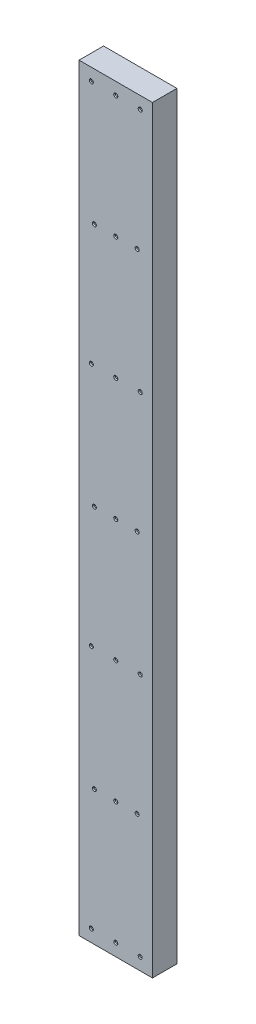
ISO-10303-21;
HEADER;
FILE_DESCRIPTION(('STEP AP214'),'2;1');
FILE_NAME('part.step','',(''),(''),'','','');
FILE_SCHEMA(('AUTOMOTIVE_DESIGN { 1 0 10303 214 1 1 1 1 }'));
ENDSEC;
DATA;
#1=APPLICATION_CONTEXT('core data for automotive mechanical design processes');
#2=APPLICATION_PROTOCOL_DEFINITION('international standard','automotive_design',2000,#1);
#3=PRODUCT_CONTEXT('',#1,'mechanical');
#4=PRODUCT('Part','Part','',(#3));
#5=PRODUCT_RELATED_PRODUCT_CATEGORY('part','',(#4));
#6=PRODUCT_DEFINITION_FORMATION('','',#4);
#7=PRODUCT_DEFINITION_CONTEXT('part definition',#1,'design');
#8=PRODUCT_DEFINITION('design','',#6,#7);
#9=PRODUCT_DEFINITION_SHAPE('','',#8);
#10=(LENGTH_UNIT() NAMED_UNIT(*) SI_UNIT(.MILLI.,.METRE.));
#11=(NAMED_UNIT(*) PLANE_ANGLE_UNIT() SI_UNIT($,.RADIAN.));
#12=(NAMED_UNIT(*) SI_UNIT($,.STERADIAN.) SOLID_ANGLE_UNIT());
#13=UNCERTAINTY_MEASURE_WITH_UNIT(LENGTH_MEASURE(1.E-05),#10,'distance_accuracy_value','');
#14=(GEOMETRIC_REPRESENTATION_CONTEXT(3) GLOBAL_UNCERTAINTY_ASSIGNED_CONTEXT((#13)) GLOBAL_UNIT_ASSIGNED_CONTEXT((#10,
#11,#12)) REPRESENTATION_CONTEXT('',''));
#15=CARTESIAN_POINT('',(0.,0.,0.));
#16=DIRECTION('',(0.,0.,1.));
#17=DIRECTION('',(1.,0.,0.));
#18=AXIS2_PLACEMENT_3D('',#15,#16,#17);
#19=CARTESIAN_POINT('',(76.2,1574.8,-25.4));
#20=DIRECTION('',(-1.,0.,0.));
#21=DIRECTION('',(0.,0.,1.));
#22=AXIS2_PLACEMENT_3D('',#19,#20,#21);
#23=PLANE('',#22);
#24=DIRECTION('',(0.,0.,-1.));
#25=VECTOR('',#24,1.);
#26=CARTESIAN_POINT('',(76.2,0.,-25.4));
#27=LINE('',#26,#25);
#28=CARTESIAN_POINT('',(76.2,0.,25.4));
#29=VERTEX_POINT('',#28);
#30=CARTESIAN_POINT('',(76.2,0.,-25.4));
#31=VERTEX_POINT('',#30);
#32=EDGE_CURVE('E95',#29,#31,#27,.T.);
#33=ORIENTED_EDGE('',*,*,#32,.T.);
#34=DIRECTION('',(0.,-1.,0.));
#35=VECTOR('',#34,1.);
#36=CARTESIAN_POINT('',(76.2,1574.8,-25.4));
#37=LINE('',#36,#35);
#38=CARTESIAN_POINT('',(76.2,1574.8,-25.4));
#39=VERTEX_POINT('',#38);
#40=EDGE_CURVE('E11',#39,#31,#37,.T.);
#41=ORIENTED_EDGE('',*,*,#40,.F.);
#42=DIRECTION('',(0.,0.,-1.));
#43=VECTOR('',#42,1.);
#44=CARTESIAN_POINT('',(76.2,1574.8,-25.4));
#45=LINE('',#44,#43);
#46=CARTESIAN_POINT('',(76.2,1574.8,25.4));
#47=VERTEX_POINT('',#46);
#48=EDGE_CURVE('E83',#47,#39,#45,.T.);
#49=ORIENTED_EDGE('',*,*,#48,.F.);
#50=DIRECTION('',(0.,-1.,0.));
#51=VECTOR('',#50,1.);
#52=CARTESIAN_POINT('',(76.2,1574.8,25.4));
#53=LINE('',#52,#51);
#54=EDGE_CURVE('E91',#47,#29,#53,.T.);
#55=ORIENTED_EDGE('',*,*,#54,.T.);
#56=EDGE_LOOP('',(#33,#41,#49,#55));
#57=FACE_BOUND('',#56,.T.);
#58=ADVANCED_FACE('F32',(#57),#23,.F.);
#59=CARTESIAN_POINT('',(-76.2,1574.8,-25.4));
#60=DIRECTION('',(0.,0.,1.));
#61=DIRECTION('',(1.,0.,0.));
#62=AXIS2_PLACEMENT_3D('',#59,#60,#61);
#63=PLANE('',#62);
#64=CARTESIAN_POINT('',(-44.45,279.4,-25.4));
#65=DIRECTION('',(0.,0.,1.));
#66=DIRECTION('',(1.,0.,0.));
#67=AXIS2_PLACEMENT_3D('',#64,#65,#66);
#68=CIRCLE('',#67,2.24789999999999);
#69=CARTESIAN_POINT('',(-42.2021,279.4,-25.4));
#70=VERTEX_POINT('',#69);
#71=EDGE_CURVE('E288',#70,#70,#68,.T.);
#72=ORIENTED_EDGE('',*,*,#71,.T.);
#73=EDGE_LOOP('',(#72));
#74=FACE_BOUND('',#73,.T.);
#75=CARTESIAN_POINT('',(0.,279.4,-25.4));
#76=DIRECTION('',(0.,0.,1.));
#77=DIRECTION('',(1.,0.,0.));
#78=AXIS2_PLACEMENT_3D('',#75,#76,#77);
#79=CIRCLE('',#78,2.24789999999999);
#80=CARTESIAN_POINT('',(2.24789999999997,279.4,-25.4));
#81=VERTEX_POINT('',#80);
#82=EDGE_CURVE('E279',#81,#81,#79,.T.);
#83=ORIENTED_EDGE('',*,*,#82,.T.);
#84=EDGE_LOOP('',(#83));
#85=FACE_BOUND('',#84,.T.);
#86=CARTESIAN_POINT('',(44.4500000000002,279.4,-25.4));
#87=DIRECTION('',(0.,0.,1.));
#88=DIRECTION('',(1.,0.,0.));
#89=AXIS2_PLACEMENT_3D('',#86,#87,#88);
#90=CIRCLE('',#89,2.24789999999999);
#91=CARTESIAN_POINT('',(46.6979000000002,279.4,-25.4));
#92=VERTEX_POINT('',#91);
#93=EDGE_CURVE('E270',#92,#92,#90,.T.);
#94=ORIENTED_EDGE('',*,*,#93,.T.);
#95=EDGE_LOOP('',(#94));
#96=FACE_BOUND('',#95,.T.);
#97=CARTESIAN_POINT('',(-44.45,787.4,-25.4));
#98=DIRECTION('',(0.,0.,1.));
#99=DIRECTION('',(1.,0.,0.));
#100=AXIS2_PLACEMENT_3D('',#97,#98,#99);
#101=CIRCLE('',#100,2.24789999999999);
#102=CARTESIAN_POINT('',(-42.2021,787.4,-25.4));
#103=VERTEX_POINT('',#102);
#104=EDGE_CURVE('E261',#103,#103,#101,.T.);
#105=ORIENTED_EDGE('',*,*,#104,.T.);
#106=EDGE_LOOP('',(#105));
#107=FACE_BOUND('',#106,.T.);
#108=CARTESIAN_POINT('',(0.,787.4,-25.4));
#109=DIRECTION('',(0.,0.,1.));
#110=DIRECTION('',(1.,0.,0.));
#111=AXIS2_PLACEMENT_3D('',#108,#109,#110);
#112=CIRCLE('',#111,2.24789999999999);
#113=CARTESIAN_POINT('',(2.24789999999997,787.4,-25.4));
#114=VERTEX_POINT('',#113);
#115=EDGE_CURVE('E252',#114,#114,#112,.T.);
#116=ORIENTED_EDGE('',*,*,#115,.T.);
#117=EDGE_LOOP('',(#116));
#118=FACE_BOUND('',#117,.T.);
#119=CARTESIAN_POINT('',(44.4500000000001,787.4,-25.4));
#120=DIRECTION('',(0.,0.,1.));
#121=DIRECTION('',(1.,0.,0.));
#122=AXIS2_PLACEMENT_3D('',#119,#120,#121);
#123=CIRCLE('',#122,2.24789999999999);
#124=CARTESIAN_POINT('',(46.6979000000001,787.4,-25.4));
#125=VERTEX_POINT('',#124);
#126=EDGE_CURVE('E243',#125,#125,#123,.T.);
#127=ORIENTED_EDGE('',*,*,#126,.T.);
#128=EDGE_LOOP('',(#127));
#129=FACE_BOUND('',#128,.T.);
#130=CARTESIAN_POINT('',(-44.45,1295.4,-25.4));
#131=DIRECTION('',(0.,0.,1.));
#132=DIRECTION('',(1.,0.,0.));
#133=AXIS2_PLACEMENT_3D('',#130,#131,#132);
#134=CIRCLE('',#133,2.24789999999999);
#135=CARTESIAN_POINT('',(-42.2021,1295.4,-25.4));
#136=VERTEX_POINT('',#135);
#137=EDGE_CURVE('E234',#136,#136,#134,.T.);
#138=ORIENTED_EDGE('',*,*,#137,.T.);
#139=EDGE_LOOP('',(#138));
#140=FACE_BOUND('',#139,.T.);
#141=CARTESIAN_POINT('',(0.,1295.4,-25.4));
#142=DIRECTION('',(0.,0.,1.));
#143=DIRECTION('',(1.,0.,0.));
#144=AXIS2_PLACEMENT_3D('',#141,#142,#143);
#145=CIRCLE('',#144,2.24789999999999);
#146=CARTESIAN_POINT('',(2.24789999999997,1295.4,-25.4));
#147=VERTEX_POINT('',#146);
#148=EDGE_CURVE('E225',#147,#147,#145,.T.);
#149=ORIENTED_EDGE('',*,*,#148,.T.);
#150=EDGE_LOOP('',(#149));
#151=FACE_BOUND('',#150,.T.);
#152=CARTESIAN_POINT('',(44.4500000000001,1295.4,-25.4));
#153=DIRECTION('',(0.,0.,1.));
#154=DIRECTION('',(1.,0.,0.));
#155=AXIS2_PLACEMENT_3D('',#152,#153,#154);
#156=CIRCLE('',#155,2.24789999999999);
#157=CARTESIAN_POINT('',(46.6979000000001,1295.4,-25.4));
#158=VERTEX_POINT('',#157);
#159=EDGE_CURVE('E216',#158,#158,#156,.T.);
#160=ORIENTED_EDGE('',*,*,#159,.T.);
#161=EDGE_LOOP('',(#160));
#162=FACE_BOUND('',#161,.T.);
#163=CARTESIAN_POINT('',(-50.8,25.4000000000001,-25.4));
#164=DIRECTION('',(0.,0.,1.));
#165=DIRECTION('',(1.,0.,0.));
#166=AXIS2_PLACEMENT_3D('',#163,#164,#165);
#167=CIRCLE('',#166,2.24789999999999);
#168=CARTESIAN_POINT('',(-48.5521,25.4000000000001,-25.4));
#169=VERTEX_POINT('',#168);
#170=EDGE_CURVE('E207',#169,#169,#167,.T.);
#171=ORIENTED_EDGE('',*,*,#170,.T.);
#172=EDGE_LOOP('',(#171));
#173=FACE_BOUND('',#172,.T.);
#174=CARTESIAN_POINT('',(0.,25.4000000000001,-25.4));
#175=DIRECTION('',(0.,0.,1.));
#176=DIRECTION('',(1.,0.,0.));
#177=AXIS2_PLACEMENT_3D('',#174,#175,#176);
#178=CIRCLE('',#177,2.24789999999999);
#179=CARTESIAN_POINT('',(2.24789999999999,25.4000000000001,-25.4));
#180=VERTEX_POINT('',#179);
#181=EDGE_CURVE('E198',#180,#180,#178,.T.);
#182=ORIENTED_EDGE('',*,*,#181,.T.);
#183=EDGE_LOOP('',(#182));
#184=FACE_BOUND('',#183,.T.);
#185=CARTESIAN_POINT('',(50.8000000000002,25.4000000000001,-25.4));
#186=DIRECTION('',(0.,0.,1.));
#187=DIRECTION('',(1.,0.,0.));
#188=AXIS2_PLACEMENT_3D('',#185,#186,#187);
#189=CIRCLE('',#188,2.24789999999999);
#190=CARTESIAN_POINT('',(53.0479000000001,25.4000000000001,-25.4));
#191=VERTEX_POINT('',#190);
#192=EDGE_CURVE('E189',#191,#191,#189,.T.);
#193=ORIENTED_EDGE('',*,*,#192,.T.);
#194=EDGE_LOOP('',(#193));
#195=FACE_BOUND('',#194,.T.);
#196=CARTESIAN_POINT('',(-50.8,1549.4,-25.4));
#197=DIRECTION('',(0.,0.,1.));
#198=DIRECTION('',(1.,0.,0.));
#199=AXIS2_PLACEMENT_3D('',#196,#197,#198);
#200=CIRCLE('',#199,2.24789999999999);
#201=CARTESIAN_POINT('',(-48.5521,1549.4,-25.4));
#202=VERTEX_POINT('',#201);
#203=EDGE_CURVE('E180',#202,#202,#200,.T.);
#204=ORIENTED_EDGE('',*,*,#203,.T.);
#205=EDGE_LOOP('',(#204));
#206=FACE_BOUND('',#205,.T.);
#207=CARTESIAN_POINT('',(0.,1549.4,-25.4));
#208=DIRECTION('',(0.,0.,1.));
#209=DIRECTION('',(1.,0.,0.));
#210=AXIS2_PLACEMENT_3D('',#207,#208,#209);
#211=CIRCLE('',#210,2.24789999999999);
#212=CARTESIAN_POINT('',(2.24789999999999,1549.4,-25.4));
#213=VERTEX_POINT('',#212);
#214=EDGE_CURVE('E171',#213,#213,#211,.T.);
#215=ORIENTED_EDGE('',*,*,#214,.T.);
#216=EDGE_LOOP('',(#215));
#217=FACE_BOUND('',#216,.T.);
#218=CARTESIAN_POINT('',(50.8,1549.4,-25.4));
#219=DIRECTION('',(0.,0.,1.));
#220=DIRECTION('',(1.,0.,0.));
#221=AXIS2_PLACEMENT_3D('',#218,#219,#220);
#222=CIRCLE('',#221,2.24789999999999);
#223=CARTESIAN_POINT('',(53.0479,1549.4,-25.4));
#224=VERTEX_POINT('',#223);
#225=EDGE_CURVE('E162',#224,#224,#222,.T.);
#226=ORIENTED_EDGE('',*,*,#225,.T.);
#227=EDGE_LOOP('',(#226));
#228=FACE_BOUND('',#227,.T.);
#229=CARTESIAN_POINT('',(-50.8,1041.4,-25.4));
#230=DIRECTION('',(0.,0.,1.));
#231=DIRECTION('',(1.,0.,0.));
#232=AXIS2_PLACEMENT_3D('',#229,#230,#231);
#233=CIRCLE('',#232,2.24789999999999);
#234=CARTESIAN_POINT('',(-48.5521,1041.4,-25.4));
#235=VERTEX_POINT('',#234);
#236=EDGE_CURVE('E153',#235,#235,#233,.T.);
#237=ORIENTED_EDGE('',*,*,#236,.T.);
#238=EDGE_LOOP('',(#237));
#239=FACE_BOUND('',#238,.T.);
#240=CARTESIAN_POINT('',(0.,1041.4,-25.4));
#241=DIRECTION('',(0.,0.,1.));
#242=DIRECTION('',(1.,0.,0.));
#243=AXIS2_PLACEMENT_3D('',#240,#241,#242);
#244=CIRCLE('',#243,2.24789999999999);
#245=CARTESIAN_POINT('',(2.24789999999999,1041.4,-25.4));
#246=VERTEX_POINT('',#245);
#247=EDGE_CURVE('E144',#246,#246,#244,.T.);
#248=ORIENTED_EDGE('',*,*,#247,.T.);
#249=EDGE_LOOP('',(#248));
#250=FACE_BOUND('',#249,.T.);
#251=CARTESIAN_POINT('',(50.8,1041.4,-25.4));
#252=DIRECTION('',(0.,0.,1.));
#253=DIRECTION('',(1.,0.,0.));
#254=AXIS2_PLACEMENT_3D('',#251,#252,#253);
#255=CIRCLE('',#254,2.24789999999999);
#256=CARTESIAN_POINT('',(53.0479,1041.4,-25.4));
#257=VERTEX_POINT('',#256);
#258=EDGE_CURVE('E135',#257,#257,#255,.T.);
#259=ORIENTED_EDGE('',*,*,#258,.T.);
#260=EDGE_LOOP('',(#259));
#261=FACE_BOUND('',#260,.T.);
#262=CARTESIAN_POINT('',(-50.8,533.4,-25.4));
#263=DIRECTION('',(0.,0.,1.));
#264=DIRECTION('',(1.,0.,0.));
#265=AXIS2_PLACEMENT_3D('',#262,#263,#264);
#266=CIRCLE('',#265,2.24789999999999);
#267=CARTESIAN_POINT('',(-48.5521,533.4,-25.4));
#268=VERTEX_POINT('',#267);
#269=EDGE_CURVE('E126',#268,#268,#266,.T.);
#270=ORIENTED_EDGE('',*,*,#269,.T.);
#271=EDGE_LOOP('',(#270));
#272=FACE_BOUND('',#271,.T.);
#273=CARTESIAN_POINT('',(0.,533.4,-25.4));
#274=DIRECTION('',(0.,0.,1.));
#275=DIRECTION('',(1.,0.,0.));
#276=AXIS2_PLACEMENT_3D('',#273,#274,#275);
#277=CIRCLE('',#276,2.24789999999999);
#278=CARTESIAN_POINT('',(2.24789999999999,533.4,-25.4));
#279=VERTEX_POINT('',#278);
#280=EDGE_CURVE('E117',#279,#279,#277,.T.);
#281=ORIENTED_EDGE('',*,*,#280,.T.);
#282=EDGE_LOOP('',(#281));
#283=FACE_BOUND('',#282,.T.);
#284=CARTESIAN_POINT('',(50.8000000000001,533.4,-25.4));
#285=DIRECTION('',(0.,0.,1.));
#286=DIRECTION('',(1.,0.,0.));
#287=AXIS2_PLACEMENT_3D('',#284,#285,#286);
#288=CIRCLE('',#287,2.24789999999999);
#289=CARTESIAN_POINT('',(53.0479000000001,533.4,-25.4));
#290=VERTEX_POINT('',#289);
#291=EDGE_CURVE('E98',#290,#290,#288,.T.);
#292=ORIENTED_EDGE('',*,*,#291,.T.);
#293=EDGE_LOOP('',(#292));
#294=FACE_BOUND('',#293,.T.);
#295=DIRECTION('',(-1.,0.,0.));
#296=VECTOR('',#295,1.);
#297=CARTESIAN_POINT('',(-76.2,0.,-25.4));
#298=LINE('',#297,#296);
#299=CARTESIAN_POINT('',(-76.2,0.,-25.4));
#300=VERTEX_POINT('',#299);
#301=EDGE_CURVE('E87',#31,#300,#298,.T.);
#302=ORIENTED_EDGE('',*,*,#301,.T.);
#303=DIRECTION('',(0.,-1.,0.));
#304=VECTOR('',#303,1.);
#305=CARTESIAN_POINT('',(-76.2,1574.8,-25.4));
#306=LINE('',#305,#304);
#307=CARTESIAN_POINT('',(-76.2,1574.8,-25.4));
#308=VERTEX_POINT('',#307);
#309=EDGE_CURVE('E40',#308,#300,#306,.T.);
#310=ORIENTED_EDGE('',*,*,#309,.F.);
#311=DIRECTION('',(-1.,0.,0.));
#312=VECTOR('',#311,1.);
#313=CARTESIAN_POINT('',(-76.2,1574.8,-25.4));
#314=LINE('',#313,#312);
#315=EDGE_CURVE('E78',#39,#308,#314,.T.);
#316=ORIENTED_EDGE('',*,*,#315,.F.);
#317=ORIENTED_EDGE('',*,*,#40,.T.);
#318=EDGE_LOOP('',(#302,#310,#316,#317));
#319=FACE_BOUND('',#318,.T.);
#320=ADVANCED_FACE('F86',(#74,#85,#96,#107,#118,#129,#140,#151,#162,#173,#184,#195,#206,#217,
#228,#239,#250,#261,#272,#283,#294,#319),#63,.F.);
#321=CARTESIAN_POINT('',(-76.2,1574.8,-25.4));
#322=DIRECTION('',(1.,0.,0.));
#323=DIRECTION('',(0.,0.,-1.));
#324=AXIS2_PLACEMENT_3D('',#321,#322,#323);
#325=PLANE('',#324);
#326=DIRECTION('',(0.,0.,1.));
#327=VECTOR('',#326,1.);
#328=CARTESIAN_POINT('',(-76.2,0.,-25.4));
#329=LINE('',#328,#327);
#330=CARTESIAN_POINT('',(-76.2,0.,25.4));
#331=VERTEX_POINT('',#330);
#332=EDGE_CURVE('E65',#300,#331,#329,.T.);
#333=ORIENTED_EDGE('',*,*,#332,.T.);
#334=DIRECTION('',(0.,-1.,0.));
#335=VECTOR('',#334,1.);
#336=CARTESIAN_POINT('',(-76.2,1574.8,25.4));
#337=LINE('',#336,#335);
#338=CARTESIAN_POINT('',(-76.2,1574.8,25.4));
#339=VERTEX_POINT('',#338);
#340=EDGE_CURVE('E88',#339,#331,#337,.T.);
#341=ORIENTED_EDGE('',*,*,#340,.F.);
#342=DIRECTION('',(0.,0.,1.));
#343=VECTOR('',#342,1.);
#344=CARTESIAN_POINT('',(-76.2,1574.8,-25.4));
#345=LINE('',#344,#343);
#346=EDGE_CURVE('E81',#308,#339,#345,.T.);
#347=ORIENTED_EDGE('',*,*,#346,.F.);
#348=ORIENTED_EDGE('',*,*,#309,.T.);
#349=EDGE_LOOP('',(#333,#341,#347,#348));
#350=FACE_BOUND('',#349,.T.);
#351=ADVANCED_FACE('F89',(#350),#325,.F.);
#352=CARTESIAN_POINT('',(-76.2,1574.8,25.4));
#353=DIRECTION('',(0.,0.,-1.));
#354=DIRECTION('',(-1.,0.,0.));
#355=AXIS2_PLACEMENT_3D('',#352,#353,#354);
#356=PLANE('',#355);
#357=CARTESIAN_POINT('',(-44.45,279.4,25.4));
#358=DIRECTION('',(0.,0.,1.));
#359=DIRECTION('',(1.,0.,0.));
#360=AXIS2_PLACEMENT_3D('',#357,#358,#359);
#361=CIRCLE('',#360,4.2164);
#362=CARTESIAN_POINT('',(-40.2336,279.4,25.4));
#363=VERTEX_POINT('',#362);
#364=EDGE_CURVE('E294',#363,#363,#361,.T.);
#365=ORIENTED_EDGE('',*,*,#364,.F.);
#366=EDGE_LOOP('',(#365));
#367=FACE_BOUND('',#366,.T.);
#368=CARTESIAN_POINT('',(0.,279.4,25.4));
#369=DIRECTION('',(0.,0.,1.));
#370=DIRECTION('',(1.,0.,0.));
#371=AXIS2_PLACEMENT_3D('',#368,#369,#370);
#372=CIRCLE('',#371,4.2164);
#373=CARTESIAN_POINT('',(4.21639999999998,279.4,25.4));
#374=VERTEX_POINT('',#373);
#375=EDGE_CURVE('E285',#374,#374,#372,.T.);
#376=ORIENTED_EDGE('',*,*,#375,.F.);
#377=EDGE_LOOP('',(#376));
#378=FACE_BOUND('',#377,.T.);
#379=CARTESIAN_POINT('',(44.4500000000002,279.4,25.4));
#380=DIRECTION('',(0.,0.,1.));
#381=DIRECTION('',(1.,0.,0.));
#382=AXIS2_PLACEMENT_3D('',#379,#380,#381);
#383=CIRCLE('',#382,4.2164);
#384=CARTESIAN_POINT('',(48.6664000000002,279.4,25.4));
#385=VERTEX_POINT('',#384);
#386=EDGE_CURVE('E276',#385,#385,#383,.T.);
#387=ORIENTED_EDGE('',*,*,#386,.F.);
#388=EDGE_LOOP('',(#387));
#389=FACE_BOUND('',#388,.T.);
#390=CARTESIAN_POINT('',(-44.45,787.4,25.4));
#391=DIRECTION('',(0.,0.,1.));
#392=DIRECTION('',(1.,0.,0.));
#393=AXIS2_PLACEMENT_3D('',#390,#391,#392);
#394=CIRCLE('',#393,4.2164);
#395=CARTESIAN_POINT('',(-40.2336,787.4,25.4));
#396=VERTEX_POINT('',#395);
#397=EDGE_CURVE('E267',#396,#396,#394,.T.);
#398=ORIENTED_EDGE('',*,*,#397,.F.);
#399=EDGE_LOOP('',(#398));
#400=FACE_BOUND('',#399,.T.);
#401=CARTESIAN_POINT('',(0.,787.4,25.4));
#402=DIRECTION('',(0.,0.,1.));
#403=DIRECTION('',(1.,0.,0.));
#404=AXIS2_PLACEMENT_3D('',#401,#402,#403);
#405=CIRCLE('',#404,4.2164);
#406=CARTESIAN_POINT('',(4.21639999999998,787.4,25.4));
#407=VERTEX_POINT('',#406);
#408=EDGE_CURVE('E258',#407,#407,#405,.T.);
#409=ORIENTED_EDGE('',*,*,#408,.F.);
#410=EDGE_LOOP('',(#409));
#411=FACE_BOUND('',#410,.T.);
#412=CARTESIAN_POINT('',(44.4500000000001,787.4,25.4));
#413=DIRECTION('',(0.,0.,1.));
#414=DIRECTION('',(1.,0.,0.));
#415=AXIS2_PLACEMENT_3D('',#412,#413,#414);
#416=CIRCLE('',#415,4.2164);
#417=CARTESIAN_POINT('',(48.6664000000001,787.4,25.4));
#418=VERTEX_POINT('',#417);
#419=EDGE_CURVE('E249',#418,#418,#416,.T.);
#420=ORIENTED_EDGE('',*,*,#419,.F.);
#421=EDGE_LOOP('',(#420));
#422=FACE_BOUND('',#421,.T.);
#423=CARTESIAN_POINT('',(-44.45,1295.4,25.4));
#424=DIRECTION('',(0.,0.,1.));
#425=DIRECTION('',(1.,0.,0.));
#426=AXIS2_PLACEMENT_3D('',#423,#424,#425);
#427=CIRCLE('',#426,4.2164);
#428=CARTESIAN_POINT('',(-40.2336,1295.4,25.4));
#429=VERTEX_POINT('',#428);
#430=EDGE_CURVE('E240',#429,#429,#427,.T.);
#431=ORIENTED_EDGE('',*,*,#430,.F.);
#432=EDGE_LOOP('',(#431));
#433=FACE_BOUND('',#432,.T.);
#434=CARTESIAN_POINT('',(0.,1295.4,25.4));
#435=DIRECTION('',(0.,0.,1.));
#436=DIRECTION('',(1.,0.,0.));
#437=AXIS2_PLACEMENT_3D('',#434,#435,#436);
#438=CIRCLE('',#437,4.2164);
#439=CARTESIAN_POINT('',(4.21639999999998,1295.4,25.4));
#440=VERTEX_POINT('',#439);
#441=EDGE_CURVE('E231',#440,#440,#438,.T.);
#442=ORIENTED_EDGE('',*,*,#441,.F.);
#443=EDGE_LOOP('',(#442));
#444=FACE_BOUND('',#443,.T.);
#445=CARTESIAN_POINT('',(44.4500000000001,1295.4,25.4));
#446=DIRECTION('',(0.,0.,1.));
#447=DIRECTION('',(1.,0.,0.));
#448=AXIS2_PLACEMENT_3D('',#445,#446,#447);
#449=CIRCLE('',#448,4.2164);
#450=CARTESIAN_POINT('',(48.6664000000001,1295.4,25.4));
#451=VERTEX_POINT('',#450);
#452=EDGE_CURVE('E222',#451,#451,#449,.T.);
#453=ORIENTED_EDGE('',*,*,#452,.F.);
#454=EDGE_LOOP('',(#453));
#455=FACE_BOUND('',#454,.T.);
#456=CARTESIAN_POINT('',(-50.8,25.4000000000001,25.4));
#457=DIRECTION('',(0.,0.,1.));
#458=DIRECTION('',(1.,0.,0.));
#459=AXIS2_PLACEMENT_3D('',#456,#457,#458);
#460=CIRCLE('',#459,4.2164);
#461=CARTESIAN_POINT('',(-46.5836,25.4000000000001,25.4));
#462=VERTEX_POINT('',#461);
#463=EDGE_CURVE('E213',#462,#462,#460,.T.);
#464=ORIENTED_EDGE('',*,*,#463,.F.);
#465=EDGE_LOOP('',(#464));
#466=FACE_BOUND('',#465,.T.);
#467=CARTESIAN_POINT('',(0.,25.4000000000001,25.4));
#468=DIRECTION('',(0.,0.,1.));
#469=DIRECTION('',(1.,0.,0.));
#470=AXIS2_PLACEMENT_3D('',#467,#468,#469);
#471=CIRCLE('',#470,4.2164);
#472=CARTESIAN_POINT('',(4.2164,25.4000000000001,25.4));
#473=VERTEX_POINT('',#472);
#474=EDGE_CURVE('E204',#473,#473,#471,.T.);
#475=ORIENTED_EDGE('',*,*,#474,.F.);
#476=EDGE_LOOP('',(#475));
#477=FACE_BOUND('',#476,.T.);
#478=CARTESIAN_POINT('',(50.8000000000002,25.4000000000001,25.4));
#479=DIRECTION('',(0.,0.,1.));
#480=DIRECTION('',(1.,0.,0.));
#481=AXIS2_PLACEMENT_3D('',#478,#479,#480);
#482=CIRCLE('',#481,4.2164);
#483=CARTESIAN_POINT('',(55.0164000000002,25.4000000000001,25.4));
#484=VERTEX_POINT('',#483);
#485=EDGE_CURVE('E195',#484,#484,#482,.T.);
#486=ORIENTED_EDGE('',*,*,#485,.F.);
#487=EDGE_LOOP('',(#486));
#488=FACE_BOUND('',#487,.T.);
#489=CARTESIAN_POINT('',(-50.8,1549.4,25.4));
#490=DIRECTION('',(0.,0.,1.));
#491=DIRECTION('',(1.,0.,0.));
#492=AXIS2_PLACEMENT_3D('',#489,#490,#491);
#493=CIRCLE('',#492,4.2164);
#494=CARTESIAN_POINT('',(-46.5836,1549.4,25.4));
#495=VERTEX_POINT('',#494);
#496=EDGE_CURVE('E186',#495,#495,#493,.T.);
#497=ORIENTED_EDGE('',*,*,#496,.F.);
#498=EDGE_LOOP('',(#497));
#499=FACE_BOUND('',#498,.T.);
#500=CARTESIAN_POINT('',(0.,1549.4,25.4));
#501=DIRECTION('',(0.,0.,1.));
#502=DIRECTION('',(1.,0.,0.));
#503=AXIS2_PLACEMENT_3D('',#500,#501,#502);
#504=CIRCLE('',#503,4.2164);
#505=CARTESIAN_POINT('',(4.2164,1549.4,25.4));
#506=VERTEX_POINT('',#505);
#507=EDGE_CURVE('E177',#506,#506,#504,.T.);
#508=ORIENTED_EDGE('',*,*,#507,.F.);
#509=EDGE_LOOP('',(#508));
#510=FACE_BOUND('',#509,.T.);
#511=CARTESIAN_POINT('',(50.8,1549.4,25.4));
#512=DIRECTION('',(0.,0.,1.));
#513=DIRECTION('',(1.,0.,0.));
#514=AXIS2_PLACEMENT_3D('',#511,#512,#513);
#515=CIRCLE('',#514,4.2164);
#516=CARTESIAN_POINT('',(55.0164,1549.4,25.4));
#517=VERTEX_POINT('',#516);
#518=EDGE_CURVE('E168',#517,#517,#515,.T.);
#519=ORIENTED_EDGE('',*,*,#518,.F.);
#520=EDGE_LOOP('',(#519));
#521=FACE_BOUND('',#520,.T.);
#522=CARTESIAN_POINT('',(-50.8,1041.4,25.4));
#523=DIRECTION('',(0.,0.,1.));
#524=DIRECTION('',(1.,0.,0.));
#525=AXIS2_PLACEMENT_3D('',#522,#523,#524);
#526=CIRCLE('',#525,4.2164);
#527=CARTESIAN_POINT('',(-46.5836,1041.4,25.4));
#528=VERTEX_POINT('',#527);
#529=EDGE_CURVE('E159',#528,#528,#526,.T.);
#530=ORIENTED_EDGE('',*,*,#529,.F.);
#531=EDGE_LOOP('',(#530));
#532=FACE_BOUND('',#531,.T.);
#533=CARTESIAN_POINT('',(0.,1041.4,25.4));
#534=DIRECTION('',(0.,0.,1.));
#535=DIRECTION('',(1.,0.,0.));
#536=AXIS2_PLACEMENT_3D('',#533,#534,#535);
#537=CIRCLE('',#536,4.2164);
#538=CARTESIAN_POINT('',(4.2164,1041.4,25.4));
#539=VERTEX_POINT('',#538);
#540=EDGE_CURVE('E150',#539,#539,#537,.T.);
#541=ORIENTED_EDGE('',*,*,#540,.F.);
#542=EDGE_LOOP('',(#541));
#543=FACE_BOUND('',#542,.T.);
#544=CARTESIAN_POINT('',(50.8,1041.4,25.4));
#545=DIRECTION('',(0.,0.,1.));
#546=DIRECTION('',(1.,0.,0.));
#547=AXIS2_PLACEMENT_3D('',#544,#545,#546);
#548=CIRCLE('',#547,4.2164);
#549=CARTESIAN_POINT('',(55.0164,1041.4,25.4));
#550=VERTEX_POINT('',#549);
#551=EDGE_CURVE('E141',#550,#550,#548,.T.);
#552=ORIENTED_EDGE('',*,*,#551,.F.);
#553=EDGE_LOOP('',(#552));
#554=FACE_BOUND('',#553,.T.);
#555=CARTESIAN_POINT('',(-50.8,533.4,25.4));
#556=DIRECTION('',(0.,0.,1.));
#557=DIRECTION('',(1.,0.,0.));
#558=AXIS2_PLACEMENT_3D('',#555,#556,#557);
#559=CIRCLE('',#558,4.2164);
#560=CARTESIAN_POINT('',(-46.5836,533.4,25.4));
#561=VERTEX_POINT('',#560);
#562=EDGE_CURVE('E132',#561,#561,#559,.T.);
#563=ORIENTED_EDGE('',*,*,#562,.F.);
#564=EDGE_LOOP('',(#563));
#565=FACE_BOUND('',#564,.T.);
#566=CARTESIAN_POINT('',(0.,533.4,25.4));
#567=DIRECTION('',(0.,0.,1.));
#568=DIRECTION('',(1.,0.,0.));
#569=AXIS2_PLACEMENT_3D('',#566,#567,#568);
#570=CIRCLE('',#569,4.2164);
#571=CARTESIAN_POINT('',(4.2164,533.4,25.4));
#572=VERTEX_POINT('',#571);
#573=EDGE_CURVE('E123',#572,#572,#570,.T.);
#574=ORIENTED_EDGE('',*,*,#573,.F.);
#575=EDGE_LOOP('',(#574));
#576=FACE_BOUND('',#575,.T.);
#577=CARTESIAN_POINT('',(50.8000000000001,533.4,25.4));
#578=DIRECTION('',(0.,0.,1.));
#579=DIRECTION('',(1.,0.,0.));
#580=AXIS2_PLACEMENT_3D('',#577,#578,#579);
#581=CIRCLE('',#580,4.2164);
#582=CARTESIAN_POINT('',(55.0164000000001,533.4,25.4));
#583=VERTEX_POINT('',#582);
#584=EDGE_CURVE('E114',#583,#583,#581,.T.);
#585=ORIENTED_EDGE('',*,*,#584,.F.);
#586=EDGE_LOOP('',(#585));
#587=FACE_BOUND('',#586,.T.);
#588=DIRECTION('',(1.,0.,0.));
#589=VECTOR('',#588,1.);
#590=CARTESIAN_POINT('',(-76.2,0.,25.4));
#591=LINE('',#590,#589);
#592=EDGE_CURVE('E71',#331,#29,#591,.T.);
#593=ORIENTED_EDGE('',*,*,#592,.T.);
#594=ORIENTED_EDGE('',*,*,#54,.F.);
#595=DIRECTION('',(1.,0.,0.));
#596=VECTOR('',#595,1.);
#597=CARTESIAN_POINT('',(-76.2,1574.8,25.4));
#598=LINE('',#597,#596);
#599=EDGE_CURVE('E48',#339,#47,#598,.T.);
#600=ORIENTED_EDGE('',*,*,#599,.F.);
#601=ORIENTED_EDGE('',*,*,#340,.T.);
#602=EDGE_LOOP('',(#593,#594,#600,#601));
#603=FACE_BOUND('',#602,.T.);
#604=ADVANCED_FACE('F103',(#367,#378,#389,#400,#411,#422,#433,#444,#455,#466,#477,#488,#499,
#510,#521,#532,#543,#554,#565,#576,#587,#603),#356,.F.);
#605=CARTESIAN_POINT('',(0.,1574.8,0.));
#606=DIRECTION('',(0.,1.,0.));
#607=DIRECTION('',(0.,0.,1.));
#608=AXIS2_PLACEMENT_3D('',#605,#606,#607);
#609=PLANE('',#608);
#610=ORIENTED_EDGE('',*,*,#48,.T.);
#611=ORIENTED_EDGE('',*,*,#315,.T.);
#612=ORIENTED_EDGE('',*,*,#346,.T.);
#613=ORIENTED_EDGE('',*,*,#599,.T.);
#614=EDGE_LOOP('',(#610,#611,#612,#613));
#615=FACE_BOUND('',#614,.T.);
#616=ADVANCED_FACE('F79',(#615),#609,.T.);
#617=CARTESIAN_POINT('',(0.,0.,0.));
#618=DIRECTION('',(0.,1.,0.));
#619=DIRECTION('',(0.,0.,1.));
#620=AXIS2_PLACEMENT_3D('',#617,#618,#619);
#621=PLANE('',#620);
#622=ORIENTED_EDGE('',*,*,#32,.F.);
#623=ORIENTED_EDGE('',*,*,#592,.F.);
#624=ORIENTED_EDGE('',*,*,#332,.F.);
#625=ORIENTED_EDGE('',*,*,#301,.F.);
#626=EDGE_LOOP('',(#622,#623,#624,#625));
#627=FACE_BOUND('',#626,.T.);
#628=ADVANCED_FACE('F106',(#627),#621,.F.);
#629=CARTESIAN_POINT('',(50.8000000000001,533.4,25.4));
#630=DIRECTION('',(0.,0.,1.));
#631=DIRECTION('',(1.,0.,0.));
#632=AXIS2_PLACEMENT_3D('',#629,#630,#631);
#633=CYLINDRICAL_SURFACE('',#632,2.24789999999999);
#634=ORIENTED_EDGE('',*,*,#291,.F.);
#635=EDGE_LOOP('',(#634));
#636=FACE_BOUND('',#635,.T.);
#637=CARTESIAN_POINT('',(50.8000000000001,533.4,23.7482323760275));
#638=DIRECTION('',(0.,0.,1.));
#639=DIRECTION('',(1.,0.,0.));
#640=AXIS2_PLACEMENT_3D('',#637,#638,#639);
#641=CIRCLE('',#640,2.24789999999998);
#642=CARTESIAN_POINT('',(53.0479000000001,533.4,23.7482323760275));
#643=VERTEX_POINT('',#642);
#644=EDGE_CURVE('E111',#643,#643,#641,.T.);
#645=ORIENTED_EDGE('',*,*,#644,.T.);
#646=EDGE_LOOP('',(#645));
#647=FACE_BOUND('',#646,.T.);
#648=ADVANCED_FACE('F346',(#636,#647),#633,.F.);
#649=CARTESIAN_POINT('',(50.8000000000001,533.4,25.4));
#650=DIRECTION('',(0.,0.,1.));
#651=DIRECTION('',(1.,0.,0.));
#652=AXIS2_PLACEMENT_3D('',#649,#650,#651);
#653=CONICAL_SURFACE('',#652,4.2164,0.872664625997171);
#654=ORIENTED_EDGE('',*,*,#644,.F.);
#655=EDGE_LOOP('',(#654));
#656=FACE_BOUND('',#655,.T.);
#657=ORIENTED_EDGE('',*,*,#584,.T.);
#658=EDGE_LOOP('',(#657));
#659=FACE_BOUND('',#658,.T.);
#660=ADVANCED_FACE('F343',(#656,#659),#653,.F.);
#661=CARTESIAN_POINT('',(0.,533.4,25.4));
#662=DIRECTION('',(0.,0.,1.));
#663=DIRECTION('',(1.,0.,0.));
#664=AXIS2_PLACEMENT_3D('',#661,#662,#663);
#665=CYLINDRICAL_SURFACE('',#664,2.24789999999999);
#666=ORIENTED_EDGE('',*,*,#280,.F.);
#667=EDGE_LOOP('',(#666));
#668=FACE_BOUND('',#667,.T.);
#669=CARTESIAN_POINT('',(0.,533.4,23.7482323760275));
#670=DIRECTION('',(0.,0.,1.));
#671=DIRECTION('',(1.,0.,0.));
#672=AXIS2_PLACEMENT_3D('',#669,#670,#671);
#673=CIRCLE('',#672,2.24789999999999);
#674=CARTESIAN_POINT('',(2.24789999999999,533.4,23.7482323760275));
#675=VERTEX_POINT('',#674);
#676=EDGE_CURVE('E120',#675,#675,#673,.T.);
#677=ORIENTED_EDGE('',*,*,#676,.T.);
#678=EDGE_LOOP('',(#677));
#679=FACE_BOUND('',#678,.T.);
#680=ADVANCED_FACE('F345',(#668,#679),#665,.F.);
#681=CARTESIAN_POINT('',(0.,533.4,25.4));
#682=DIRECTION('',(0.,0.,1.));
#683=DIRECTION('',(1.,0.,0.));
#684=AXIS2_PLACEMENT_3D('',#681,#682,#683);
#685=CONICAL_SURFACE('',#684,4.2164,0.87266462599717);
#686=ORIENTED_EDGE('',*,*,#676,.F.);
#687=EDGE_LOOP('',(#686));
#688=FACE_BOUND('',#687,.T.);
#689=ORIENTED_EDGE('',*,*,#573,.T.);
#690=EDGE_LOOP('',(#689));
#691=FACE_BOUND('',#690,.T.);
#692=ADVANCED_FACE('F353',(#688,#691),#685,.F.);
#693=CARTESIAN_POINT('',(-50.8,533.4,25.4));
#694=DIRECTION('',(0.,0.,1.));
#695=DIRECTION('',(1.,0.,0.));
#696=AXIS2_PLACEMENT_3D('',#693,#694,#695);
#697=CYLINDRICAL_SURFACE('',#696,2.24789999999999);
#698=ORIENTED_EDGE('',*,*,#269,.F.);
#699=EDGE_LOOP('',(#698));
#700=FACE_BOUND('',#699,.T.);
#701=CARTESIAN_POINT('',(-50.8,533.4,23.7482323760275));
#702=DIRECTION('',(0.,0.,1.));
#703=DIRECTION('',(1.,0.,0.));
#704=AXIS2_PLACEMENT_3D('',#701,#702,#703);
#705=CIRCLE('',#704,2.24789999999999);
#706=CARTESIAN_POINT('',(-48.5521,533.4,23.7482323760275));
#707=VERTEX_POINT('',#706);
#708=EDGE_CURVE('E129',#707,#707,#705,.T.);
#709=ORIENTED_EDGE('',*,*,#708,.T.);
#710=EDGE_LOOP('',(#709));
#711=FACE_BOUND('',#710,.T.);
#712=ADVANCED_FACE('F417',(#700,#711),#697,.F.);
#713=CARTESIAN_POINT('',(-50.8,533.4,25.4));
#714=DIRECTION('',(0.,0.,1.));
#715=DIRECTION('',(1.,0.,0.));
#716=AXIS2_PLACEMENT_3D('',#713,#714,#715);
#717=CONICAL_SURFACE('',#716,4.2164,0.87266462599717);
#718=ORIENTED_EDGE('',*,*,#708,.F.);
#719=EDGE_LOOP('',(#718));
#720=FACE_BOUND('',#719,.T.);
#721=ORIENTED_EDGE('',*,*,#562,.T.);
#722=EDGE_LOOP('',(#721));
#723=FACE_BOUND('',#722,.T.);
#724=ADVANCED_FACE('F426',(#720,#723),#717,.F.);
#725=CARTESIAN_POINT('',(50.8,1041.4,25.4));
#726=DIRECTION('',(0.,0.,1.));
#727=DIRECTION('',(1.,0.,0.));
#728=AXIS2_PLACEMENT_3D('',#725,#726,#727);
#729=CYLINDRICAL_SURFACE('',#728,2.24789999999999);
#730=ORIENTED_EDGE('',*,*,#258,.F.);
#731=EDGE_LOOP('',(#730));
#732=FACE_BOUND('',#731,.T.);
#733=CARTESIAN_POINT('',(50.8,1041.4,23.7482323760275));
#734=DIRECTION('',(0.,0.,1.));
#735=DIRECTION('',(1.,0.,0.));
#736=AXIS2_PLACEMENT_3D('',#733,#734,#735);
#737=CIRCLE('',#736,2.24789999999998);
#738=CARTESIAN_POINT('',(53.0479,1041.4,23.7482323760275));
#739=VERTEX_POINT('',#738);
#740=EDGE_CURVE('E138',#739,#739,#737,.T.);
#741=ORIENTED_EDGE('',*,*,#740,.T.);
#742=EDGE_LOOP('',(#741));
#743=FACE_BOUND('',#742,.T.);
#744=ADVANCED_FACE('F435',(#732,#743),#729,.F.);
#745=CARTESIAN_POINT('',(50.8,1041.4,25.4));
#746=DIRECTION('',(0.,0.,1.));
#747=DIRECTION('',(1.,0.,0.));
#748=AXIS2_PLACEMENT_3D('',#745,#746,#747);
#749=CONICAL_SURFACE('',#748,4.2164,0.872664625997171);
#750=ORIENTED_EDGE('',*,*,#740,.F.);
#751=EDGE_LOOP('',(#750));
#752=FACE_BOUND('',#751,.T.);
#753=ORIENTED_EDGE('',*,*,#551,.T.);
#754=EDGE_LOOP('',(#753));
#755=FACE_BOUND('',#754,.T.);
#756=ADVANCED_FACE('F444',(#752,#755),#749,.F.);
#757=CARTESIAN_POINT('',(0.,1041.4,25.4));
#758=DIRECTION('',(0.,0.,1.));
#759=DIRECTION('',(1.,0.,0.));
#760=AXIS2_PLACEMENT_3D('',#757,#758,#759);
#761=CYLINDRICAL_SURFACE('',#760,2.24789999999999);
#762=ORIENTED_EDGE('',*,*,#247,.F.);
#763=EDGE_LOOP('',(#762));
#764=FACE_BOUND('',#763,.T.);
#765=CARTESIAN_POINT('',(0.,1041.4,23.7482323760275));
#766=DIRECTION('',(0.,0.,1.));
#767=DIRECTION('',(1.,0.,0.));
#768=AXIS2_PLACEMENT_3D('',#765,#766,#767);
#769=CIRCLE('',#768,2.24789999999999);
#770=CARTESIAN_POINT('',(2.24789999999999,1041.4,23.7482323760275));
#771=VERTEX_POINT('',#770);
#772=EDGE_CURVE('E147',#771,#771,#769,.T.);
#773=ORIENTED_EDGE('',*,*,#772,.T.);
#774=EDGE_LOOP('',(#773));
#775=FACE_BOUND('',#774,.T.);
#776=ADVANCED_FACE('F453',(#764,#775),#761,.F.);
#777=CARTESIAN_POINT('',(0.,1041.4,25.4));
#778=DIRECTION('',(0.,0.,1.));
#779=DIRECTION('',(1.,0.,0.));
#780=AXIS2_PLACEMENT_3D('',#777,#778,#779);
#781=CONICAL_SURFACE('',#780,4.2164,0.87266462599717);
#782=ORIENTED_EDGE('',*,*,#772,.F.);
#783=EDGE_LOOP('',(#782));
#784=FACE_BOUND('',#783,.T.);
#785=ORIENTED_EDGE('',*,*,#540,.T.);
#786=EDGE_LOOP('',(#785));
#787=FACE_BOUND('',#786,.T.);
#788=ADVANCED_FACE('F462',(#784,#787),#781,.F.);
#789=CARTESIAN_POINT('',(-50.8,1041.4,25.4));
#790=DIRECTION('',(0.,0.,1.));
#791=DIRECTION('',(1.,0.,0.));
#792=AXIS2_PLACEMENT_3D('',#789,#790,#791);
#793=CYLINDRICAL_SURFACE('',#792,2.24789999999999);
#794=ORIENTED_EDGE('',*,*,#236,.F.);
#795=EDGE_LOOP('',(#794));
#796=FACE_BOUND('',#795,.T.);
#797=CARTESIAN_POINT('',(-50.8,1041.4,23.7482323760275));
#798=DIRECTION('',(0.,0.,1.));
#799=DIRECTION('',(1.,0.,0.));
#800=AXIS2_PLACEMENT_3D('',#797,#798,#799);
#801=CIRCLE('',#800,2.24789999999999);
#802=CARTESIAN_POINT('',(-48.5521,1041.4,23.7482323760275));
#803=VERTEX_POINT('',#802);
#804=EDGE_CURVE('E156',#803,#803,#801,.T.);
#805=ORIENTED_EDGE('',*,*,#804,.T.);
#806=EDGE_LOOP('',(#805));
#807=FACE_BOUND('',#806,.T.);
#808=ADVANCED_FACE('F471',(#796,#807),#793,.F.);
#809=CARTESIAN_POINT('',(-50.8,1041.4,25.4));
#810=DIRECTION('',(0.,0.,1.));
#811=DIRECTION('',(1.,0.,0.));
#812=AXIS2_PLACEMENT_3D('',#809,#810,#811);
#813=CONICAL_SURFACE('',#812,4.2164,0.87266462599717);
#814=ORIENTED_EDGE('',*,*,#804,.F.);
#815=EDGE_LOOP('',(#814));
#816=FACE_BOUND('',#815,.T.);
#817=ORIENTED_EDGE('',*,*,#529,.T.);
#818=EDGE_LOOP('',(#817));
#819=FACE_BOUND('',#818,.T.);
#820=ADVANCED_FACE('F480',(#816,#819),#813,.F.);
#821=CARTESIAN_POINT('',(50.8,1549.4,25.4));
#822=DIRECTION('',(0.,0.,1.));
#823=DIRECTION('',(1.,0.,0.));
#824=AXIS2_PLACEMENT_3D('',#821,#822,#823);
#825=CYLINDRICAL_SURFACE('',#824,2.24789999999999);
#826=ORIENTED_EDGE('',*,*,#225,.F.);
#827=EDGE_LOOP('',(#826));
#828=FACE_BOUND('',#827,.T.);
#829=CARTESIAN_POINT('',(50.8,1549.4,23.7482323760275));
#830=DIRECTION('',(0.,0.,1.));
#831=DIRECTION('',(1.,0.,0.));
#832=AXIS2_PLACEMENT_3D('',#829,#830,#831);
#833=CIRCLE('',#832,2.24789999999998);
#834=CARTESIAN_POINT('',(53.0479,1549.4,23.7482323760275));
#835=VERTEX_POINT('',#834);
#836=EDGE_CURVE('E165',#835,#835,#833,.T.);
#837=ORIENTED_EDGE('',*,*,#836,.T.);
#838=EDGE_LOOP('',(#837));
#839=FACE_BOUND('',#838,.T.);
#840=ADVANCED_FACE('F489',(#828,#839),#825,.F.);
#841=CARTESIAN_POINT('',(50.8,1549.4,25.4));
#842=DIRECTION('',(0.,0.,1.));
#843=DIRECTION('',(1.,0.,0.));
#844=AXIS2_PLACEMENT_3D('',#841,#842,#843);
#845=CONICAL_SURFACE('',#844,4.2164,0.872664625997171);
#846=ORIENTED_EDGE('',*,*,#836,.F.);
#847=EDGE_LOOP('',(#846));
#848=FACE_BOUND('',#847,.T.);
#849=ORIENTED_EDGE('',*,*,#518,.T.);
#850=EDGE_LOOP('',(#849));
#851=FACE_BOUND('',#850,.T.);
#852=ADVANCED_FACE('F498',(#848,#851),#845,.F.);
#853=CARTESIAN_POINT('',(0.,1549.4,25.4));
#854=DIRECTION('',(0.,0.,1.));
#855=DIRECTION('',(1.,0.,0.));
#856=AXIS2_PLACEMENT_3D('',#853,#854,#855);
#857=CYLINDRICAL_SURFACE('',#856,2.24789999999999);
#858=ORIENTED_EDGE('',*,*,#214,.F.);
#859=EDGE_LOOP('',(#858));
#860=FACE_BOUND('',#859,.T.);
#861=CARTESIAN_POINT('',(0.,1549.4,23.7482323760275));
#862=DIRECTION('',(0.,0.,1.));
#863=DIRECTION('',(1.,0.,0.));
#864=AXIS2_PLACEMENT_3D('',#861,#862,#863);
#865=CIRCLE('',#864,2.24789999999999);
#866=CARTESIAN_POINT('',(2.24789999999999,1549.4,23.7482323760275));
#867=VERTEX_POINT('',#866);
#868=EDGE_CURVE('E174',#867,#867,#865,.T.);
#869=ORIENTED_EDGE('',*,*,#868,.T.);
#870=EDGE_LOOP('',(#869));
#871=FACE_BOUND('',#870,.T.);
#872=ADVANCED_FACE('F507',(#860,#871),#857,.F.);
#873=CARTESIAN_POINT('',(0.,1549.4,25.4));
#874=DIRECTION('',(0.,0.,1.));
#875=DIRECTION('',(1.,0.,0.));
#876=AXIS2_PLACEMENT_3D('',#873,#874,#875);
#877=CONICAL_SURFACE('',#876,4.2164,0.87266462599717);
#878=ORIENTED_EDGE('',*,*,#868,.F.);
#879=EDGE_LOOP('',(#878));
#880=FACE_BOUND('',#879,.T.);
#881=ORIENTED_EDGE('',*,*,#507,.T.);
#882=EDGE_LOOP('',(#881));
#883=FACE_BOUND('',#882,.T.);
#884=ADVANCED_FACE('F516',(#880,#883),#877,.F.);
#885=CARTESIAN_POINT('',(-50.8,1549.4,25.4));
#886=DIRECTION('',(0.,0.,1.));
#887=DIRECTION('',(1.,0.,0.));
#888=AXIS2_PLACEMENT_3D('',#885,#886,#887);
#889=CYLINDRICAL_SURFACE('',#888,2.24789999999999);
#890=ORIENTED_EDGE('',*,*,#203,.F.);
#891=EDGE_LOOP('',(#890));
#892=FACE_BOUND('',#891,.T.);
#893=CARTESIAN_POINT('',(-50.8,1549.4,23.7482323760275));
#894=DIRECTION('',(0.,0.,1.));
#895=DIRECTION('',(1.,0.,0.));
#896=AXIS2_PLACEMENT_3D('',#893,#894,#895);
#897=CIRCLE('',#896,2.24789999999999);
#898=CARTESIAN_POINT('',(-48.5521,1549.4,23.7482323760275));
#899=VERTEX_POINT('',#898);
#900=EDGE_CURVE('E183',#899,#899,#897,.T.);
#901=ORIENTED_EDGE('',*,*,#900,.T.);
#902=EDGE_LOOP('',(#901));
#903=FACE_BOUND('',#902,.T.);
#904=ADVANCED_FACE('F525',(#892,#903),#889,.F.);
#905=CARTESIAN_POINT('',(-50.8,1549.4,25.4));
#906=DIRECTION('',(0.,0.,1.));
#907=DIRECTION('',(1.,0.,0.));
#908=AXIS2_PLACEMENT_3D('',#905,#906,#907);
#909=CONICAL_SURFACE('',#908,4.2164,0.87266462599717);
#910=ORIENTED_EDGE('',*,*,#900,.F.);
#911=EDGE_LOOP('',(#910));
#912=FACE_BOUND('',#911,.T.);
#913=ORIENTED_EDGE('',*,*,#496,.T.);
#914=EDGE_LOOP('',(#913));
#915=FACE_BOUND('',#914,.T.);
#916=ADVANCED_FACE('F534',(#912,#915),#909,.F.);
#917=CARTESIAN_POINT('',(50.8000000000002,25.4000000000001,25.4));
#918=DIRECTION('',(0.,0.,1.));
#919=DIRECTION('',(1.,0.,0.));
#920=AXIS2_PLACEMENT_3D('',#917,#918,#919);
#921=CYLINDRICAL_SURFACE('',#920,2.24789999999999);
#922=ORIENTED_EDGE('',*,*,#192,.F.);
#923=EDGE_LOOP('',(#922));
#924=FACE_BOUND('',#923,.T.);
#925=CARTESIAN_POINT('',(50.8000000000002,25.4000000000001,23.7482323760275));
#926=DIRECTION('',(0.,0.,1.));
#927=DIRECTION('',(1.,0.,0.));
#928=AXIS2_PLACEMENT_3D('',#925,#926,#927);
#929=CIRCLE('',#928,2.24789999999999);
#930=CARTESIAN_POINT('',(53.0479000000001,25.4000000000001,23.7482323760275));
#931=VERTEX_POINT('',#930);
#932=EDGE_CURVE('E192',#931,#931,#929,.T.);
#933=ORIENTED_EDGE('',*,*,#932,.T.);
#934=EDGE_LOOP('',(#933));
#935=FACE_BOUND('',#934,.T.);
#936=ADVANCED_FACE('F543',(#924,#935),#921,.F.);
#937=CARTESIAN_POINT('',(50.8000000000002,25.4000000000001,25.4));
#938=DIRECTION('',(0.,0.,1.));
#939=DIRECTION('',(1.,0.,0.));
#940=AXIS2_PLACEMENT_3D('',#937,#938,#939);
#941=CONICAL_SURFACE('',#940,4.2164,0.87266462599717);
#942=ORIENTED_EDGE('',*,*,#932,.F.);
#943=EDGE_LOOP('',(#942));
#944=FACE_BOUND('',#943,.T.);
#945=ORIENTED_EDGE('',*,*,#485,.T.);
#946=EDGE_LOOP('',(#945));
#947=FACE_BOUND('',#946,.T.);
#948=ADVANCED_FACE('F552',(#944,#947),#941,.F.);
#949=CARTESIAN_POINT('',(0.,25.4000000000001,25.4));
#950=DIRECTION('',(0.,0.,1.));
#951=DIRECTION('',(1.,0.,0.));
#952=AXIS2_PLACEMENT_3D('',#949,#950,#951);
#953=CYLINDRICAL_SURFACE('',#952,2.24789999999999);
#954=ORIENTED_EDGE('',*,*,#181,.F.);
#955=EDGE_LOOP('',(#954));
#956=FACE_BOUND('',#955,.T.);
#957=CARTESIAN_POINT('',(0.,25.4000000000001,23.7482323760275));
#958=DIRECTION('',(0.,0.,1.));
#959=DIRECTION('',(1.,0.,0.));
#960=AXIS2_PLACEMENT_3D('',#957,#958,#959);
#961=CIRCLE('',#960,2.24789999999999);
#962=CARTESIAN_POINT('',(2.24789999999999,25.4000000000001,23.7482323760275));
#963=VERTEX_POINT('',#962);
#964=EDGE_CURVE('E201',#963,#963,#961,.T.);
#965=ORIENTED_EDGE('',*,*,#964,.T.);
#966=EDGE_LOOP('',(#965));
#967=FACE_BOUND('',#966,.T.);
#968=ADVANCED_FACE('F561',(#956,#967),#953,.F.);
#969=CARTESIAN_POINT('',(0.,25.4000000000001,25.4));
#970=DIRECTION('',(0.,0.,1.));
#971=DIRECTION('',(1.,0.,0.));
#972=AXIS2_PLACEMENT_3D('',#969,#970,#971);
#973=CONICAL_SURFACE('',#972,4.2164,0.87266462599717);
#974=ORIENTED_EDGE('',*,*,#964,.F.);
#975=EDGE_LOOP('',(#974));
#976=FACE_BOUND('',#975,.T.);
#977=ORIENTED_EDGE('',*,*,#474,.T.);
#978=EDGE_LOOP('',(#977));
#979=FACE_BOUND('',#978,.T.);
#980=ADVANCED_FACE('F570',(#976,#979),#973,.F.);
#981=CARTESIAN_POINT('',(-50.8,25.4000000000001,25.4));
#982=DIRECTION('',(0.,0.,1.));
#983=DIRECTION('',(1.,0.,0.));
#984=AXIS2_PLACEMENT_3D('',#981,#982,#983);
#985=CYLINDRICAL_SURFACE('',#984,2.24789999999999);
#986=ORIENTED_EDGE('',*,*,#170,.F.);
#987=EDGE_LOOP('',(#986));
#988=FACE_BOUND('',#987,.T.);
#989=CARTESIAN_POINT('',(-50.8,25.4000000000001,23.7482323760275));
#990=DIRECTION('',(0.,0.,1.));
#991=DIRECTION('',(1.,0.,0.));
#992=AXIS2_PLACEMENT_3D('',#989,#990,#991);
#993=CIRCLE('',#992,2.24789999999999);
#994=CARTESIAN_POINT('',(-48.5521,25.4000000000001,23.7482323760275));
#995=VERTEX_POINT('',#994);
#996=EDGE_CURVE('E210',#995,#995,#993,.T.);
#997=ORIENTED_EDGE('',*,*,#996,.T.);
#998=EDGE_LOOP('',(#997));
#999=FACE_BOUND('',#998,.T.);
#1000=ADVANCED_FACE('F579',(#988,#999),#985,.F.);
#1001=CARTESIAN_POINT('',(-50.8,25.4000000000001,25.4));
#1002=DIRECTION('',(0.,0.,1.));
#1003=DIRECTION('',(1.,0.,0.));
#1004=AXIS2_PLACEMENT_3D('',#1001,#1002,#1003);
#1005=CONICAL_SURFACE('',#1004,4.2164,0.87266462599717);
#1006=ORIENTED_EDGE('',*,*,#996,.F.);
#1007=EDGE_LOOP('',(#1006));
#1008=FACE_BOUND('',#1007,.T.);
#1009=ORIENTED_EDGE('',*,*,#463,.T.);
#1010=EDGE_LOOP('',(#1009));
#1011=FACE_BOUND('',#1010,.T.);
#1012=ADVANCED_FACE('F587',(#1008,#1011),#1005,.F.);
#1013=CARTESIAN_POINT('',(44.4500000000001,1295.4,25.4));
#1014=DIRECTION('',(0.,0.,1.));
#1015=DIRECTION('',(1.,0.,0.));
#1016=AXIS2_PLACEMENT_3D('',#1013,#1014,#1015);
#1017=CYLINDRICAL_SURFACE('',#1016,2.24789999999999);
#1018=ORIENTED_EDGE('',*,*,#159,.F.);
#1019=EDGE_LOOP('',(#1018));
#1020=FACE_BOUND('',#1019,.T.);
#1021=CARTESIAN_POINT('',(44.4500000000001,1295.4,23.7482323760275));
#1022=DIRECTION('',(0.,0.,1.));
#1023=DIRECTION('',(1.,0.,0.));
#1024=AXIS2_PLACEMENT_3D('',#1021,#1022,#1023);
#1025=CIRCLE('',#1024,2.24789999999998);
#1026=CARTESIAN_POINT('',(46.6979000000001,1295.4,23.7482323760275));
#1027=VERTEX_POINT('',#1026);
#1028=EDGE_CURVE('E219',#1027,#1027,#1025,.T.);
#1029=ORIENTED_EDGE('',*,*,#1028,.T.);
#1030=EDGE_LOOP('',(#1029));
#1031=FACE_BOUND('',#1030,.T.);
#1032=ADVANCED_FACE('F595',(#1020,#1031),#1017,.F.);
#1033=CARTESIAN_POINT('',(44.4500000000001,1295.4,25.4));
#1034=DIRECTION('',(0.,0.,1.));
#1035=DIRECTION('',(1.,0.,0.));
#1036=AXIS2_PLACEMENT_3D('',#1033,#1034,#1035);
#1037=CONICAL_SURFACE('',#1036,4.2164,0.872664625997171);
#1038=ORIENTED_EDGE('',*,*,#1028,.F.);
#1039=EDGE_LOOP('',(#1038));
#1040=FACE_BOUND('',#1039,.T.);
#1041=ORIENTED_EDGE('',*,*,#452,.T.);
#1042=EDGE_LOOP('',(#1041));
#1043=FACE_BOUND('',#1042,.T.);
#1044=ADVANCED_FACE('F607',(#1040,#1043),#1037,.F.);
#1045=CARTESIAN_POINT('',(0.,1295.4,25.4));
#1046=DIRECTION('',(0.,0.,1.));
#1047=DIRECTION('',(1.,0.,0.));
#1048=AXIS2_PLACEMENT_3D('',#1045,#1046,#1047);
#1049=CYLINDRICAL_SURFACE('',#1048,2.24789999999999);
#1050=ORIENTED_EDGE('',*,*,#148,.F.);
#1051=EDGE_LOOP('',(#1050));
#1052=FACE_BOUND('',#1051,.T.);
#1053=CARTESIAN_POINT('',(0.,1295.4,23.7482323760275));
#1054=DIRECTION('',(0.,0.,1.));
#1055=DIRECTION('',(1.,0.,0.));
#1056=AXIS2_PLACEMENT_3D('',#1053,#1054,#1055);
#1057=CIRCLE('',#1056,2.24789999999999);
#1058=CARTESIAN_POINT('',(2.24789999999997,1295.4,23.7482323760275));
#1059=VERTEX_POINT('',#1058);
#1060=EDGE_CURVE('E228',#1059,#1059,#1057,.T.);
#1061=ORIENTED_EDGE('',*,*,#1060,.T.);
#1062=EDGE_LOOP('',(#1061));
#1063=FACE_BOUND('',#1062,.T.);
#1064=ADVANCED_FACE('F616',(#1052,#1063),#1049,.F.);
#1065=CARTESIAN_POINT('',(0.,1295.4,25.4));
#1066=DIRECTION('',(0.,0.,1.));
#1067=DIRECTION('',(1.,0.,0.));
#1068=AXIS2_PLACEMENT_3D('',#1065,#1066,#1067);
#1069=CONICAL_SURFACE('',#1068,4.2164,0.87266462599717);
#1070=ORIENTED_EDGE('',*,*,#1060,.F.);
#1071=EDGE_LOOP('',(#1070));
#1072=FACE_BOUND('',#1071,.T.);
#1073=ORIENTED_EDGE('',*,*,#441,.T.);
#1074=EDGE_LOOP('',(#1073));
#1075=FACE_BOUND('',#1074,.T.);
#1076=ADVANCED_FACE('F625',(#1072,#1075),#1069,.F.);
#1077=CARTESIAN_POINT('',(-44.45,1295.4,25.4));
#1078=DIRECTION('',(0.,0.,1.));
#1079=DIRECTION('',(1.,0.,0.));
#1080=AXIS2_PLACEMENT_3D('',#1077,#1078,#1079);
#1081=CYLINDRICAL_SURFACE('',#1080,2.24789999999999);
#1082=ORIENTED_EDGE('',*,*,#137,.F.);
#1083=EDGE_LOOP('',(#1082));
#1084=FACE_BOUND('',#1083,.T.);
#1085=CARTESIAN_POINT('',(-44.45,1295.4,23.7482323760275));
#1086=DIRECTION('',(0.,0.,1.));
#1087=DIRECTION('',(1.,0.,0.));
#1088=AXIS2_PLACEMENT_3D('',#1085,#1086,#1087);
#1089=CIRCLE('',#1088,2.24789999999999);
#1090=CARTESIAN_POINT('',(-42.2021,1295.4,23.7482323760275));
#1091=VERTEX_POINT('',#1090);
#1092=EDGE_CURVE('E237',#1091,#1091,#1089,.T.);
#1093=ORIENTED_EDGE('',*,*,#1092,.T.);
#1094=EDGE_LOOP('',(#1093));
#1095=FACE_BOUND('',#1094,.T.);
#1096=ADVANCED_FACE('F634',(#1084,#1095),#1081,.F.);
#1097=CARTESIAN_POINT('',(-44.45,1295.4,25.4));
#1098=DIRECTION('',(0.,0.,1.));
#1099=DIRECTION('',(1.,0.,0.));
#1100=AXIS2_PLACEMENT_3D('',#1097,#1098,#1099);
#1101=CONICAL_SURFACE('',#1100,4.2164,0.87266462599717);
#1102=ORIENTED_EDGE('',*,*,#1092,.F.);
#1103=EDGE_LOOP('',(#1102));
#1104=FACE_BOUND('',#1103,.T.);
#1105=ORIENTED_EDGE('',*,*,#430,.T.);
#1106=EDGE_LOOP('',(#1105));
#1107=FACE_BOUND('',#1106,.T.);
#1108=ADVANCED_FACE('F643',(#1104,#1107),#1101,.F.);
#1109=CARTESIAN_POINT('',(44.4500000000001,787.4,25.4));
#1110=DIRECTION('',(0.,0.,1.));
#1111=DIRECTION('',(1.,0.,0.));
#1112=AXIS2_PLACEMENT_3D('',#1109,#1110,#1111);
#1113=CYLINDRICAL_SURFACE('',#1112,2.24789999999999);
#1114=ORIENTED_EDGE('',*,*,#126,.F.);
#1115=EDGE_LOOP('',(#1114));
#1116=FACE_BOUND('',#1115,.T.);
#1117=CARTESIAN_POINT('',(44.4500000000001,787.4,23.7482323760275));
#1118=DIRECTION('',(0.,0.,1.));
#1119=DIRECTION('',(1.,0.,0.));
#1120=AXIS2_PLACEMENT_3D('',#1117,#1118,#1119);
#1121=CIRCLE('',#1120,2.24789999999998);
#1122=CARTESIAN_POINT('',(46.6979000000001,787.4,23.7482323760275));
#1123=VERTEX_POINT('',#1122);
#1124=EDGE_CURVE('E246',#1123,#1123,#1121,.T.);
#1125=ORIENTED_EDGE('',*,*,#1124,.T.);
#1126=EDGE_LOOP('',(#1125));
#1127=FACE_BOUND('',#1126,.T.);
#1128=ADVANCED_FACE('F652',(#1116,#1127),#1113,.F.);
#1129=CARTESIAN_POINT('',(44.4500000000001,787.4,25.4));
#1130=DIRECTION('',(0.,0.,1.));
#1131=DIRECTION('',(1.,0.,0.));
#1132=AXIS2_PLACEMENT_3D('',#1129,#1130,#1131);
#1133=CONICAL_SURFACE('',#1132,4.2164,0.872664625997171);
#1134=ORIENTED_EDGE('',*,*,#1124,.F.);
#1135=EDGE_LOOP('',(#1134));
#1136=FACE_BOUND('',#1135,.T.);
#1137=ORIENTED_EDGE('',*,*,#419,.T.);
#1138=EDGE_LOOP('',(#1137));
#1139=FACE_BOUND('',#1138,.T.);
#1140=ADVANCED_FACE('F661',(#1136,#1139),#1133,.F.);
#1141=CARTESIAN_POINT('',(0.,787.4,25.4));
#1142=DIRECTION('',(0.,0.,1.));
#1143=DIRECTION('',(1.,0.,0.));
#1144=AXIS2_PLACEMENT_3D('',#1141,#1142,#1143);
#1145=CYLINDRICAL_SURFACE('',#1144,2.24789999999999);
#1146=ORIENTED_EDGE('',*,*,#115,.F.);
#1147=EDGE_LOOP('',(#1146));
#1148=FACE_BOUND('',#1147,.T.);
#1149=CARTESIAN_POINT('',(0.,787.4,23.7482323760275));
#1150=DIRECTION('',(0.,0.,1.));
#1151=DIRECTION('',(1.,0.,0.));
#1152=AXIS2_PLACEMENT_3D('',#1149,#1150,#1151);
#1153=CIRCLE('',#1152,2.24789999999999);
#1154=CARTESIAN_POINT('',(2.24789999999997,787.4,23.7482323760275));
#1155=VERTEX_POINT('',#1154);
#1156=EDGE_CURVE('E255',#1155,#1155,#1153,.T.);
#1157=ORIENTED_EDGE('',*,*,#1156,.T.);
#1158=EDGE_LOOP('',(#1157));
#1159=FACE_BOUND('',#1158,.T.);
#1160=ADVANCED_FACE('F670',(#1148,#1159),#1145,.F.);
#1161=CARTESIAN_POINT('',(0.,787.4,25.4));
#1162=DIRECTION('',(0.,0.,1.));
#1163=DIRECTION('',(1.,0.,0.));
#1164=AXIS2_PLACEMENT_3D('',#1161,#1162,#1163);
#1165=CONICAL_SURFACE('',#1164,4.2164,0.87266462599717);
#1166=ORIENTED_EDGE('',*,*,#1156,.F.);
#1167=EDGE_LOOP('',(#1166));
#1168=FACE_BOUND('',#1167,.T.);
#1169=ORIENTED_EDGE('',*,*,#408,.T.);
#1170=EDGE_LOOP('',(#1169));
#1171=FACE_BOUND('',#1170,.T.);
#1172=ADVANCED_FACE('F679',(#1168,#1171),#1165,.F.);
#1173=CARTESIAN_POINT('',(-44.45,787.4,25.4));
#1174=DIRECTION('',(0.,0.,1.));
#1175=DIRECTION('',(1.,0.,0.));
#1176=AXIS2_PLACEMENT_3D('',#1173,#1174,#1175);
#1177=CYLINDRICAL_SURFACE('',#1176,2.24789999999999);
#1178=ORIENTED_EDGE('',*,*,#104,.F.);
#1179=EDGE_LOOP('',(#1178));
#1180=FACE_BOUND('',#1179,.T.);
#1181=CARTESIAN_POINT('',(-44.45,787.4,23.7482323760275));
#1182=DIRECTION('',(0.,0.,1.));
#1183=DIRECTION('',(1.,0.,0.));
#1184=AXIS2_PLACEMENT_3D('',#1181,#1182,#1183);
#1185=CIRCLE('',#1184,2.24789999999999);
#1186=CARTESIAN_POINT('',(-42.2021,787.4,23.7482323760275));
#1187=VERTEX_POINT('',#1186);
#1188=EDGE_CURVE('E264',#1187,#1187,#1185,.T.);
#1189=ORIENTED_EDGE('',*,*,#1188,.T.);
#1190=EDGE_LOOP('',(#1189));
#1191=FACE_BOUND('',#1190,.T.);
#1192=ADVANCED_FACE('F688',(#1180,#1191),#1177,.F.);
#1193=CARTESIAN_POINT('',(-44.45,787.4,25.4));
#1194=DIRECTION('',(0.,0.,1.));
#1195=DIRECTION('',(1.,0.,0.));
#1196=AXIS2_PLACEMENT_3D('',#1193,#1194,#1195);
#1197=CONICAL_SURFACE('',#1196,4.2164,0.87266462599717);
#1198=ORIENTED_EDGE('',*,*,#1188,.F.);
#1199=EDGE_LOOP('',(#1198));
#1200=FACE_BOUND('',#1199,.T.);
#1201=ORIENTED_EDGE('',*,*,#397,.T.);
#1202=EDGE_LOOP('',(#1201));
#1203=FACE_BOUND('',#1202,.T.);
#1204=ADVANCED_FACE('F697',(#1200,#1203),#1197,.F.);
#1205=CARTESIAN_POINT('',(44.4500000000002,279.4,25.4));
#1206=DIRECTION('',(0.,0.,1.));
#1207=DIRECTION('',(1.,0.,0.));
#1208=AXIS2_PLACEMENT_3D('',#1205,#1206,#1207);
#1209=CYLINDRICAL_SURFACE('',#1208,2.24789999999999);
#1210=ORIENTED_EDGE('',*,*,#93,.F.);
#1211=EDGE_LOOP('',(#1210));
#1212=FACE_BOUND('',#1211,.T.);
#1213=CARTESIAN_POINT('',(44.4500000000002,279.4,23.7482323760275));
#1214=DIRECTION('',(0.,0.,1.));
#1215=DIRECTION('',(1.,0.,0.));
#1216=AXIS2_PLACEMENT_3D('',#1213,#1214,#1215);
#1217=CIRCLE('',#1216,2.24789999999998);
#1218=CARTESIAN_POINT('',(46.6979000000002,279.4,23.7482323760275));
#1219=VERTEX_POINT('',#1218);
#1220=EDGE_CURVE('E273',#1219,#1219,#1217,.T.);
#1221=ORIENTED_EDGE('',*,*,#1220,.T.);
#1222=EDGE_LOOP('',(#1221));
#1223=FACE_BOUND('',#1222,.T.);
#1224=ADVANCED_FACE('F706',(#1212,#1223),#1209,.F.);
#1225=CARTESIAN_POINT('',(44.4500000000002,279.4,25.4));
#1226=DIRECTION('',(0.,0.,1.));
#1227=DIRECTION('',(1.,0.,0.));
#1228=AXIS2_PLACEMENT_3D('',#1225,#1226,#1227);
#1229=CONICAL_SURFACE('',#1228,4.2164,0.872664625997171);
#1230=ORIENTED_EDGE('',*,*,#1220,.F.);
#1231=EDGE_LOOP('',(#1230));
#1232=FACE_BOUND('',#1231,.T.);
#1233=ORIENTED_EDGE('',*,*,#386,.T.);
#1234=EDGE_LOOP('',(#1233));
#1235=FACE_BOUND('',#1234,.T.);
#1236=ADVANCED_FACE('F715',(#1232,#1235),#1229,.F.);
#1237=CARTESIAN_POINT('',(0.,279.4,25.4));
#1238=DIRECTION('',(0.,0.,1.));
#1239=DIRECTION('',(1.,0.,0.));
#1240=AXIS2_PLACEMENT_3D('',#1237,#1238,#1239);
#1241=CYLINDRICAL_SURFACE('',#1240,2.24789999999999);
#1242=ORIENTED_EDGE('',*,*,#82,.F.);
#1243=EDGE_LOOP('',(#1242));
#1244=FACE_BOUND('',#1243,.T.);
#1245=CARTESIAN_POINT('',(0.,279.4,23.7482323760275));
#1246=DIRECTION('',(0.,0.,1.));
#1247=DIRECTION('',(1.,0.,0.));
#1248=AXIS2_PLACEMENT_3D('',#1245,#1246,#1247);
#1249=CIRCLE('',#1248,2.24789999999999);
#1250=CARTESIAN_POINT('',(2.24789999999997,279.4,23.7482323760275));
#1251=VERTEX_POINT('',#1250);
#1252=EDGE_CURVE('E282',#1251,#1251,#1249,.T.);
#1253=ORIENTED_EDGE('',*,*,#1252,.T.);
#1254=EDGE_LOOP('',(#1253));
#1255=FACE_BOUND('',#1254,.T.);
#1256=ADVANCED_FACE('F724',(#1244,#1255),#1241,.F.);
#1257=CARTESIAN_POINT('',(0.,279.4,25.4));
#1258=DIRECTION('',(0.,0.,1.));
#1259=DIRECTION('',(1.,0.,0.));
#1260=AXIS2_PLACEMENT_3D('',#1257,#1258,#1259);
#1261=CONICAL_SURFACE('',#1260,4.2164,0.87266462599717);
#1262=ORIENTED_EDGE('',*,*,#1252,.F.);
#1263=EDGE_LOOP('',(#1262));
#1264=FACE_BOUND('',#1263,.T.);
#1265=ORIENTED_EDGE('',*,*,#375,.T.);
#1266=EDGE_LOOP('',(#1265));
#1267=FACE_BOUND('',#1266,.T.);
#1268=ADVANCED_FACE('F733',(#1264,#1267),#1261,.F.);
#1269=CARTESIAN_POINT('',(-44.45,279.4,25.4));
#1270=DIRECTION('',(0.,0.,1.));
#1271=DIRECTION('',(1.,0.,0.));
#1272=AXIS2_PLACEMENT_3D('',#1269,#1270,#1271);
#1273=CYLINDRICAL_SURFACE('',#1272,2.24789999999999);
#1274=ORIENTED_EDGE('',*,*,#71,.F.);
#1275=EDGE_LOOP('',(#1274));
#1276=FACE_BOUND('',#1275,.T.);
#1277=CARTESIAN_POINT('',(-44.45,279.4,23.7482323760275));
#1278=DIRECTION('',(0.,0.,1.));
#1279=DIRECTION('',(1.,0.,0.));
#1280=AXIS2_PLACEMENT_3D('',#1277,#1278,#1279);
#1281=CIRCLE('',#1280,2.24789999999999);
#1282=CARTESIAN_POINT('',(-42.2021,279.4,23.7482323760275));
#1283=VERTEX_POINT('',#1282);
#1284=EDGE_CURVE('E291',#1283,#1283,#1281,.T.);
#1285=ORIENTED_EDGE('',*,*,#1284,.T.);
#1286=EDGE_LOOP('',(#1285));
#1287=FACE_BOUND('',#1286,.T.);
#1288=ADVANCED_FACE('F742',(#1276,#1287),#1273,.F.);
#1289=CARTESIAN_POINT('',(-44.45,279.4,25.4));
#1290=DIRECTION('',(0.,0.,1.));
#1291=DIRECTION('',(1.,0.,0.));
#1292=AXIS2_PLACEMENT_3D('',#1289,#1290,#1291);
#1293=CONICAL_SURFACE('',#1292,4.2164,0.87266462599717);
#1294=ORIENTED_EDGE('',*,*,#1284,.F.);
#1295=EDGE_LOOP('',(#1294));
#1296=FACE_BOUND('',#1295,.T.);
#1297=ORIENTED_EDGE('',*,*,#364,.T.);
#1298=EDGE_LOOP('',(#1297));
#1299=FACE_BOUND('',#1298,.T.);
#1300=ADVANCED_FACE('F298',(#1296,#1299),#1293,.F.);
#1301=CLOSED_SHELL('',(#58,#320,#351,#604,#616,#628,#648,#660,#680,#692,#712,#724,#744,#756,
#776,#788,#808,#820,#840,#852,#872,#884,#904,#916,#936,#948,#968,#980,#1000,#1012,#1032,#1044,
#1064,#1076,#1096,#1108,#1128,#1140,#1160,#1172,#1192,#1204,#1224,#1236,#1256,#1268,#1288,#1300));
#1302=MANIFOLD_SOLID_BREP('B2',#1301);
#1303=ADVANCED_BREP_SHAPE_REPRESENTATION('',(#18,#1302),#14);
#1304=SHAPE_DEFINITION_REPRESENTATION(#9,#1303);
ENDSEC;
END-ISO-10303-21;
